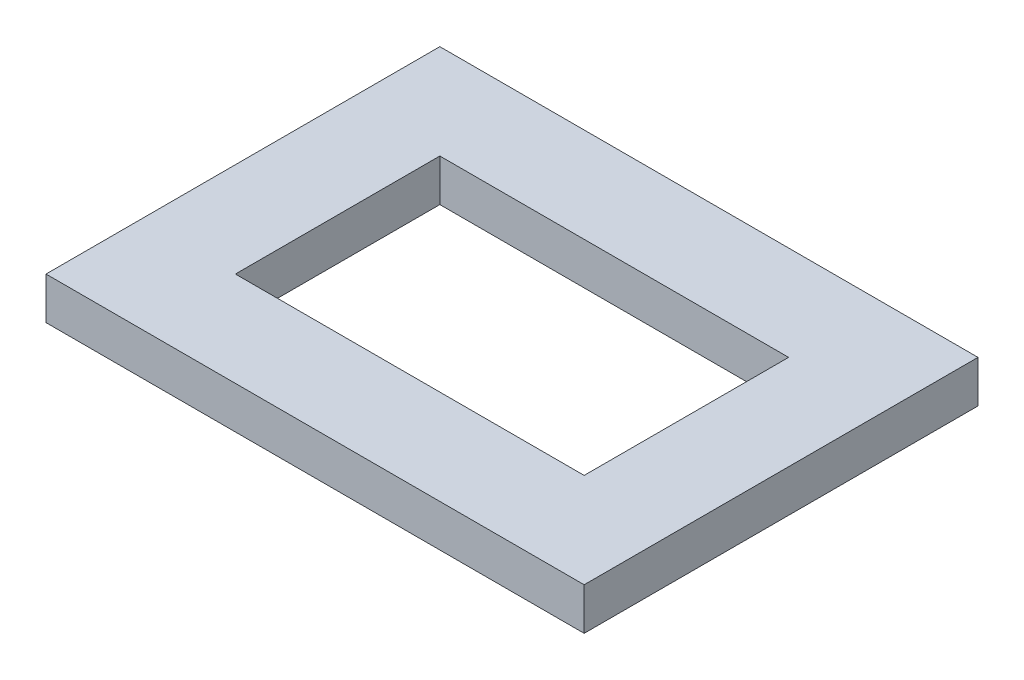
from build123d import *

# Parameters (mm, degrees)
SKETCH1_W           = 284.15
SKETCH1_H           = 207.95
SKETCH1_W_2         = 184.15
SKETCH1_H_2         = 107.95
BOSS_EXTRUDE1_DEPTH = 22.225


with BuildPart() as part:
    # Sketch1 → Boss-Extrude1 (new body)
    with BuildSketch(Plane(origin=(0, 0, 0), x_dir=(1, 0, 0), z_dir=(0, 1, 0))):
        Rectangle(SKETCH1_W, SKETCH1_H)
        Rectangle(SKETCH1_W_2, SKETCH1_H_2, mode=Mode.SUBTRACT)
    extrude(amount=BOSS_EXTRUDE1_DEPTH)


solid = part.part
